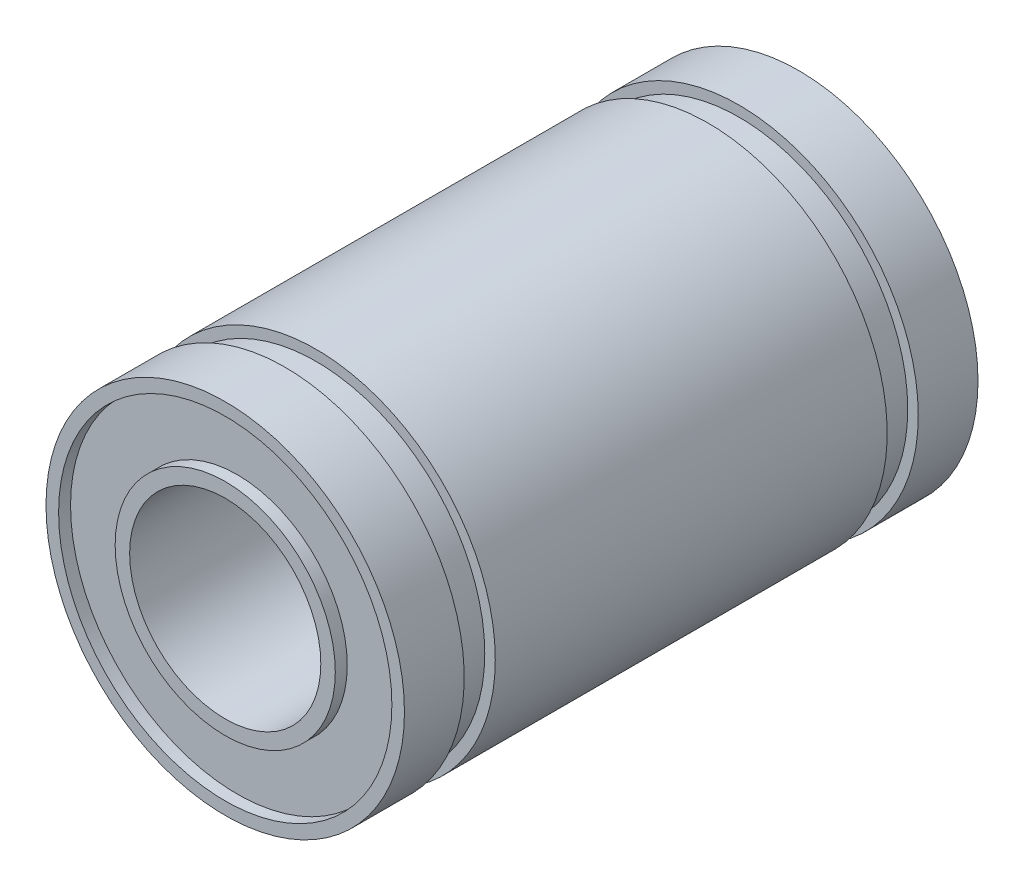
from build123d import *

# Parameters (mm, degrees)
SKETCH1_R           = 7.5
SKETCH1_R_2         = 4
BOSS_EXTRUDE1_DEPTH = 12
SKETCH2_W           = 0.934125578
SKETCH2_H           = 1.3
SKETCH3_R           = 6.972941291
SKETCH3_R_2         = 4.606383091
CUT_EXTRUDE1_DEPTH  = 0.5


with BuildPart() as part:
    # Sketch1 → Boss-Extrude1 (new, symmetric)
    with BuildSketch(Plane.XY):
        Circle(SKETCH1_R)
        Circle(SKETCH1_R_2, mode=Mode.SUBTRACT)
    extrude(amount=BOSS_EXTRUDE1_DEPTH, both=True)

    # Sketch2 → Cut-Revolve1 (revolve, cut)
    with BuildSketch(Plane(origin=(0, 0, 0), x_dir=(1, 0, 0), z_dir=(0, 1, 0)), mode=Mode.PRIVATE) as cut_revolve1_sk:
        with Locations((7.527516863, -8.85)):
            Rectangle(SKETCH2_W, SKETCH2_H)
        with Locations((7.527516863, 8.85)):
            Rectangle(SKETCH2_W, SKETCH2_H)
    revolve(cut_revolve1_sk.sketch.rotate(Axis((0, 0, -13.646970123), (0, 0, 1)), 180), axis=Axis((0, 0, -13.646970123), (0, 0, 1)), mode=Mode.SUBTRACT)

    # Sketch3 → Cut-Extrude1 (cut)
    with BuildSketch(Plane(origin=(0, 0, -12), x_dir=(-1, 0, 0), z_dir=(0, 0, -1))):
        Circle(SKETCH3_R)
        Circle(SKETCH3_R_2, mode=Mode.SUBTRACT)
    cut_extrude1 = extrude(amount=-CUT_EXTRUDE1_DEPTH, mode=Mode.SUBTRACT)

    # Mirror1: Cut-Extrude1 across plane
    add(cut_extrude1.mirror(Plane.XY), mode=Mode.SUBTRACT)


solid = part.part
